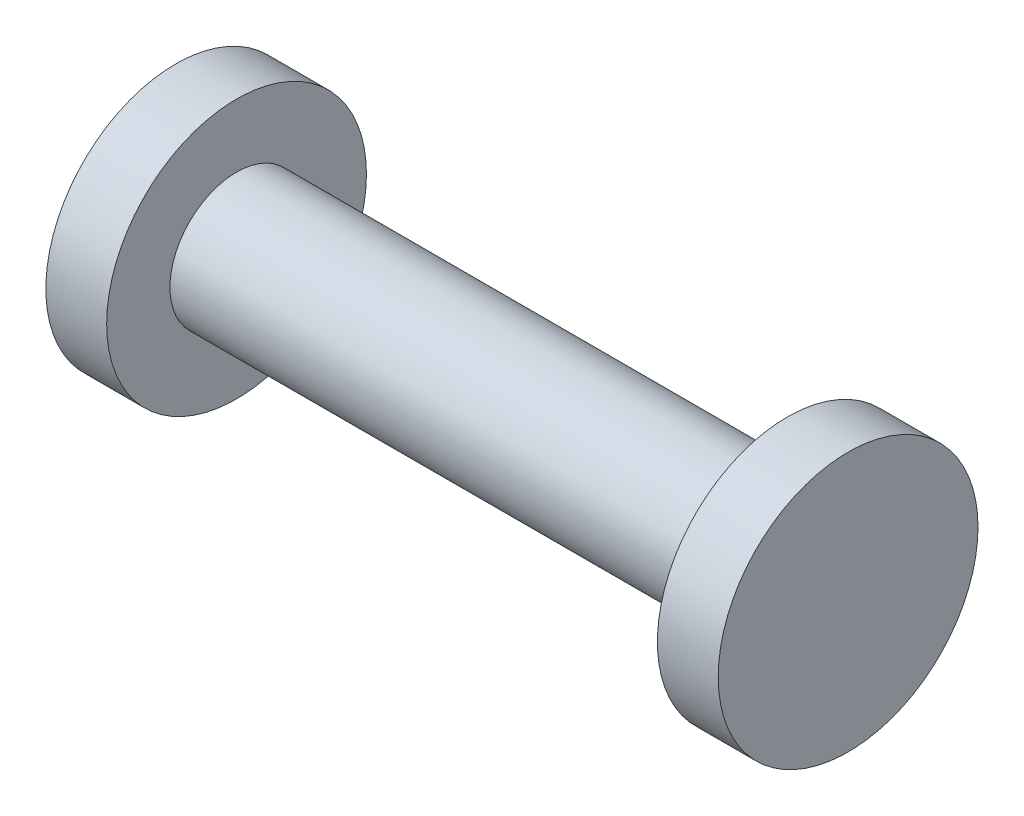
ISO-10303-21;
HEADER;
FILE_DESCRIPTION(('STEP AP214'),'2;1');
FILE_NAME('part.step','',(''),(''),'','','');
FILE_SCHEMA(('AUTOMOTIVE_DESIGN { 1 0 10303 214 1 1 1 1 }'));
ENDSEC;
DATA;
#1=APPLICATION_CONTEXT('core data for automotive mechanical design processes');
#2=APPLICATION_PROTOCOL_DEFINITION('international standard','automotive_design',2000,#1);
#3=PRODUCT_CONTEXT('',#1,'mechanical');
#4=PRODUCT('Part','Part','',(#3));
#5=PRODUCT_RELATED_PRODUCT_CATEGORY('part','',(#4));
#6=PRODUCT_DEFINITION_FORMATION('','',#4);
#7=PRODUCT_DEFINITION_CONTEXT('part definition',#1,'design');
#8=PRODUCT_DEFINITION('design','',#6,#7);
#9=PRODUCT_DEFINITION_SHAPE('','',#8);
#10=(LENGTH_UNIT() NAMED_UNIT(*) SI_UNIT(.MILLI.,.METRE.));
#11=(NAMED_UNIT(*) PLANE_ANGLE_UNIT() SI_UNIT($,.RADIAN.));
#12=(NAMED_UNIT(*) SI_UNIT($,.STERADIAN.) SOLID_ANGLE_UNIT());
#13=UNCERTAINTY_MEASURE_WITH_UNIT(LENGTH_MEASURE(1.E-05),#10,'distance_accuracy_value','');
#14=(GEOMETRIC_REPRESENTATION_CONTEXT(3) GLOBAL_UNCERTAINTY_ASSIGNED_CONTEXT((#13)) GLOBAL_UNIT_ASSIGNED_CONTEXT((#10,
#11,#12)) REPRESENTATION_CONTEXT('',''));
#15=CARTESIAN_POINT('',(0.,0.,0.));
#16=DIRECTION('',(0.,0.,1.));
#17=DIRECTION('',(1.,0.,0.));
#18=AXIS2_PLACEMENT_3D('',#15,#16,#17);
#19=CARTESIAN_POINT('',(-9.02,55.6,-88.));
#20=DIRECTION('',(1.,0.,0.));
#21=DIRECTION('',(0.,0.,-1.));
#22=AXIS2_PLACEMENT_3D('',#19,#20,#21);
#23=CYLINDRICAL_SURFACE('',#22,2.18);
#24=CARTESIAN_POINT('',(9.01,55.6,-88.));
#25=DIRECTION('',(-1.,0.,0.));
#26=DIRECTION('',(0.,0.,1.));
#27=AXIS2_PLACEMENT_3D('',#24,#25,#26);
#28=CIRCLE('',#27,2.18);
#29=CARTESIAN_POINT('',(9.01,55.6,-85.82));
#30=VERTEX_POINT('',#29);
#31=EDGE_CURVE('E9',#30,#30,#28,.F.);
#32=ORIENTED_EDGE('',*,*,#31,.F.);
#33=EDGE_LOOP('',(#32));
#34=FACE_BOUND('',#33,.T.);
#35=CARTESIAN_POINT('',(-9.01,55.6,-88.));
#36=DIRECTION('',(1.,0.,0.));
#37=DIRECTION('',(0.,0.,-1.));
#38=AXIS2_PLACEMENT_3D('',#35,#36,#37);
#39=CIRCLE('',#38,2.18);
#40=CARTESIAN_POINT('',(-9.01,55.6,-90.18));
#41=VERTEX_POINT('',#40);
#42=EDGE_CURVE('E20',#41,#41,#39,.F.);
#43=ORIENTED_EDGE('',*,*,#42,.F.);
#44=EDGE_LOOP('',(#43));
#45=FACE_BOUND('',#44,.T.);
#46=ADVANCED_FACE('F14',(#34,#45),#23,.T.);
#47=CARTESIAN_POINT('',(-9.01,55.6,-88.));
#48=DIRECTION('',(1.,0.,0.));
#49=DIRECTION('',(0.,0.,-1.));
#50=AXIS2_PLACEMENT_3D('',#47,#48,#49);
#51=PLANE('',#50);
#52=ORIENTED_EDGE('',*,*,#42,.T.);
#53=EDGE_LOOP('',(#52));
#54=FACE_BOUND('',#53,.T.);
#55=CARTESIAN_POINT('',(-9.01,55.6,-88.));
#56=DIRECTION('',(-1.,0.,0.));
#57=DIRECTION('',(0.,0.,1.));
#58=AXIS2_PLACEMENT_3D('',#55,#56,#57);
#59=CIRCLE('',#58,4.25);
#60=CARTESIAN_POINT('',(-9.01,55.6,-83.75));
#61=VERTEX_POINT('',#60);
#62=EDGE_CURVE('E24',#61,#61,#59,.T.);
#63=ORIENTED_EDGE('',*,*,#62,.F.);
#64=EDGE_LOOP('',(#63));
#65=FACE_BOUND('',#64,.T.);
#66=ADVANCED_FACE('F60',(#54,#65),#51,.T.);
#67=CARTESIAN_POINT('',(-11.,55.6,-88.));
#68=DIRECTION('',(-1.,0.,0.));
#69=DIRECTION('',(0.,0.,1.));
#70=AXIS2_PLACEMENT_3D('',#67,#68,#69);
#71=PLANE('',#70);
#72=CARTESIAN_POINT('',(-11.,55.6,-88.));
#73=DIRECTION('',(1.,0.,0.));
#74=DIRECTION('',(0.,0.,-1.));
#75=AXIS2_PLACEMENT_3D('',#72,#73,#74);
#76=CIRCLE('',#75,4.25);
#77=CARTESIAN_POINT('',(-11.,55.6,-92.25));
#78=VERTEX_POINT('',#77);
#79=EDGE_CURVE('E29',#78,#78,#76,.T.);
#80=ORIENTED_EDGE('',*,*,#79,.F.);
#81=EDGE_LOOP('',(#80));
#82=FACE_BOUND('',#81,.T.);
#83=ADVANCED_FACE('F62',(#82),#71,.T.);
#84=CARTESIAN_POINT('',(-11.,55.6,-88.));
#85=DIRECTION('',(1.,0.,0.));
#86=DIRECTION('',(0.,0.,-1.));
#87=AXIS2_PLACEMENT_3D('',#84,#85,#86);
#88=CYLINDRICAL_SURFACE('',#87,4.25);
#89=ORIENTED_EDGE('',*,*,#62,.T.);
#90=EDGE_LOOP('',(#89));
#91=FACE_BOUND('',#90,.T.);
#92=ORIENTED_EDGE('',*,*,#79,.T.);
#93=EDGE_LOOP('',(#92));
#94=FACE_BOUND('',#93,.T.);
#95=ADVANCED_FACE('F52',(#91,#94),#88,.T.);
#96=CARTESIAN_POINT('',(11.,55.6,-88.));
#97=DIRECTION('',(1.,0.,0.));
#98=DIRECTION('',(0.,0.,-1.));
#99=AXIS2_PLACEMENT_3D('',#96,#97,#98);
#100=PLANE('',#99);
#101=CARTESIAN_POINT('',(11.,55.6,-88.));
#102=DIRECTION('',(-1.,0.,0.));
#103=DIRECTION('',(0.,0.,1.));
#104=AXIS2_PLACEMENT_3D('',#101,#102,#103);
#105=CIRCLE('',#104,4.25);
#106=CARTESIAN_POINT('',(11.,55.6,-83.75));
#107=VERTEX_POINT('',#106);
#108=EDGE_CURVE('E31',#107,#107,#105,.T.);
#109=ORIENTED_EDGE('',*,*,#108,.F.);
#110=EDGE_LOOP('',(#109));
#111=FACE_BOUND('',#110,.T.);
#112=ADVANCED_FACE('F42',(#111),#100,.T.);
#113=CARTESIAN_POINT('',(9.01,55.6,-88.));
#114=DIRECTION('',(-1.,0.,0.));
#115=DIRECTION('',(0.,0.,1.));
#116=AXIS2_PLACEMENT_3D('',#113,#114,#115);
#117=PLANE('',#116);
#118=ORIENTED_EDGE('',*,*,#31,.T.);
#119=EDGE_LOOP('',(#118));
#120=FACE_BOUND('',#119,.T.);
#121=CARTESIAN_POINT('',(9.01,55.6,-88.));
#122=DIRECTION('',(1.,0.,0.));
#123=DIRECTION('',(0.,0.,-1.));
#124=AXIS2_PLACEMENT_3D('',#121,#122,#123);
#125=CIRCLE('',#124,4.25);
#126=CARTESIAN_POINT('',(9.01,55.6,-92.25));
#127=VERTEX_POINT('',#126);
#128=EDGE_CURVE('E38',#127,#127,#125,.T.);
#129=ORIENTED_EDGE('',*,*,#128,.F.);
#130=EDGE_LOOP('',(#129));
#131=FACE_BOUND('',#130,.T.);
#132=ADVANCED_FACE('F45',(#120,#131),#117,.T.);
#133=CARTESIAN_POINT('',(9.01,55.6,-88.));
#134=DIRECTION('',(1.,0.,0.));
#135=DIRECTION('',(0.,0.,-1.));
#136=AXIS2_PLACEMENT_3D('',#133,#134,#135);
#137=CYLINDRICAL_SURFACE('',#136,4.25);
#138=ORIENTED_EDGE('',*,*,#108,.T.);
#139=EDGE_LOOP('',(#138));
#140=FACE_BOUND('',#139,.T.);
#141=ORIENTED_EDGE('',*,*,#128,.T.);
#142=EDGE_LOOP('',(#141));
#143=FACE_BOUND('',#142,.T.);
#144=ADVANCED_FACE('F37',(#140,#143),#137,.T.);
#145=CLOSED_SHELL('',(#46,#66,#83,#95,#112,#132,#144));
#146=MANIFOLD_SOLID_BREP('B1',#145);
#147=ADVANCED_BREP_SHAPE_REPRESENTATION('',(#18,#146),#14);
#148=SHAPE_DEFINITION_REPRESENTATION(#9,#147);
ENDSEC;
END-ISO-10303-21;
